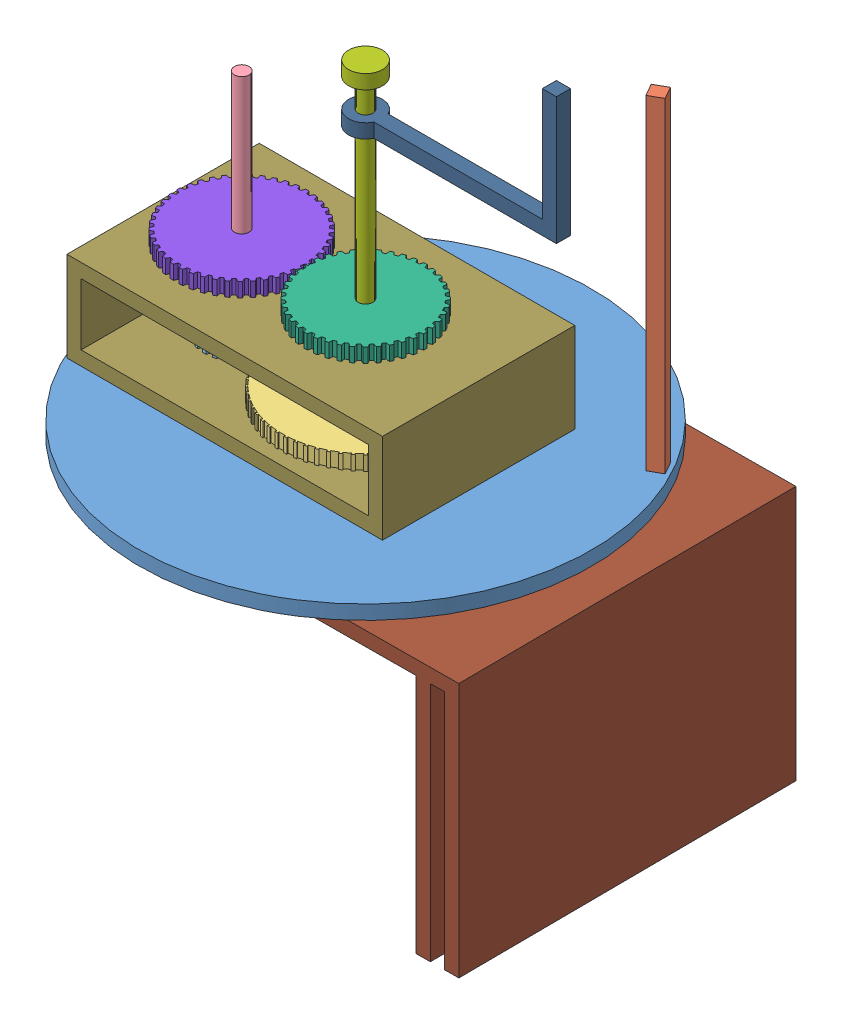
SolidWorks assembly spinning mech.SLDASM, configuration Default (file format 4700). Lengths in mm.
Overall size (138.36 146.23 138.36).
12 component instances, 12 part files, 20 mates.
Components (placement in the parent):
- table-1: table.SLDPRT [Default] at (-11.816 -18.3919 44.1509) x (0.871664 0 -0.490103) z (0.490103 0 0.871664) size (101.6 3.17 101.6)
- dude-1: dude.SLDPRT [Default] at (32.4124 -18.3919 21.1042) x (0 1 0) z (-0.871664 0 0.490103) size (76.2 3.17 3.17)
- gear 1-1: gear 1.SLDPRT [Default] at (-11.816 -8.6632 44.1509) x (0.207487 0 -0.978238) z (0 -1 0) size (38.08 38.08 3.17)
- long shaft-2: long shaft.SLDPRT [Default] at (-39.3675 38.9618 44.3975) x (0 -1 0) z (0 0 1) size (50.8 3.3 3.3)
- gear 2-1: gear 2.SLDPRT [Default] at (-39.3675 -11.8382 44.3975) x (0 1 0) z (-0.189839 0 0.981815) size (3.17 16.75 16.78)
- gear 3-1: gear 3.SLDPRT [Default] at (-11.816 8.3728 44.1509) x (0 -1 0) z (-0.310896 0 0.950444) size (3.17 26.92 26.92)
- shaft 2-1: shaft 2.SLDPRT [Default] at (-11.816 8.3728 44.1509) x (0 1 0) z (0 0 1) size (46.35 7.62 7.62)
- gear 4-1: gear 4.SLDPRT [Default] at (-39.3675 5.1978 44.3975) size (29.47 3.17 29.45)
- SHAFT 1-1: SHAFT 1.SLDPRT [Default] at (-11.816 -53.1132 44.1509) size (3.3 44.45 3.3)
- part 1-1: part 1.SLDPRT [Default] at (-11.816 41.9862 44.1509) x (1 0 0) z (0 1 0) size (48.26 7.62 28.58)
- Part2-1: Part2.SLDPRT [Default] at (-37.4667 -21.5669 6.2192) x (-0.999978 0 0.006595) z (0 1 0) size (83.82 76.2 57.28)
- Part3-1: Part3.SLDPRT [Default] at (-39.502 -15.2169 44.1509) size (70.87 20.19 43.18)
Mates (geometry in assembly coordinates):
- Coincident4: coincident aligned: plane of table-1 through (-11.816 -18.3919 44.1509) normal (0 -1 0); plane of dude-1 through (30.8563 -18.3919 18.3367) normal (0 -1 0)
- Concentric6: concentric anti-aligned: circle of long shaft-2; circle of gear 2-1
- Concentric9: concentric anti-aligned: circle of long shaft-2; circle of gear 4-1
- Concentric10: concentric anti-aligned: circle of table-1; circle of SHAFT 1-1
- Coincident17: coincident anti-aligned: circle of gear 1-1; circle of SHAFT 1-1
- Concentric11: concentric anti-aligned: circle of gear 1-1; circle of shaft 2-1
- Coincident18: coincident anti-aligned: circle of gear 3-1; circle of shaft 2-1
- Coincident19: coincident aligned: plane of gear 1-1 through (-11.816 -8.6632 44.1509) normal (0 1 0); plane of SHAFT 1-1 through (-11.816 -8.6632 44.1509) normal (0 1 0)
- Coincident20: coincident aligned: plane of gear 3-1 through (-11.816 8.3728 44.1509) normal (0 1 0); plane of gear 4-1 through (-39.3675 8.3728 44.3975) normal (0 1 0)
- Coincident21: coincident aligned: plane of gear 1-1 through (-11.816 -8.6632 44.1509) normal (0 1 0); plane of gear 2-1 through (-39.3675 -8.6632 44.3975) normal (0 1 0)
- Concentric15: concentric aligned: circle of shaft 2-1; circle of part 1-1
- Coincident24: coincident aligned: plane of long shaft-2 through (-39.3675 -11.8382 44.3975) normal (0 -1 0); plane of gear 2-1 through (-39.3675 -11.8382 44.3975) normal (0 -1 0)
- Coincident25: coincident anti-aligned: plane of table-1 through (32.4124 -18.3919 21.1042) normal (-0.490103 0 -0.871664); plane of dude-1 through (32.4124 57.8081 21.1042) normal (0.490103 0 0.871664)
- Coincident26: coincident anti-aligned: plane of table-1 through (29.6448 -18.3919 22.6603) normal (0.871664 0 -0.490103); plane of dude-1 through (29.6448 57.8081 22.6603) normal (-0.871664 0 0.490103)
- Coincident27: coincident aligned: plane of table-1 through (-11.816 -18.3919 44.1509) normal (0 -1 0); plane of dude-1 through (30.8563 -18.3919 18.3367) normal (0 -1 0)
- Concentric18: concentric aligned: circle of SHAFT 1-1; circle of Part2-1
- Coincident30: coincident anti-aligned: plane of table-1 through (-11.816 -18.3919 44.1509) normal (0 -1 0); plane of Part2-1 through (-37.4667 -18.3919 6.2192) normal (0 1 0)
- Coincident31: coincident anti-aligned: plane of table-1 through (-11.816 -15.2169 44.1509) normal (0 1 0); plane of Part3-1 through (-57.282 -15.2169 65.7409) normal (0 -1 0)
- Concentric19: concentric: circle of long shaft-2; circle of Part3-1
- Concentric20: concentric: circle of shaft 2-1; circle of Part3-1
